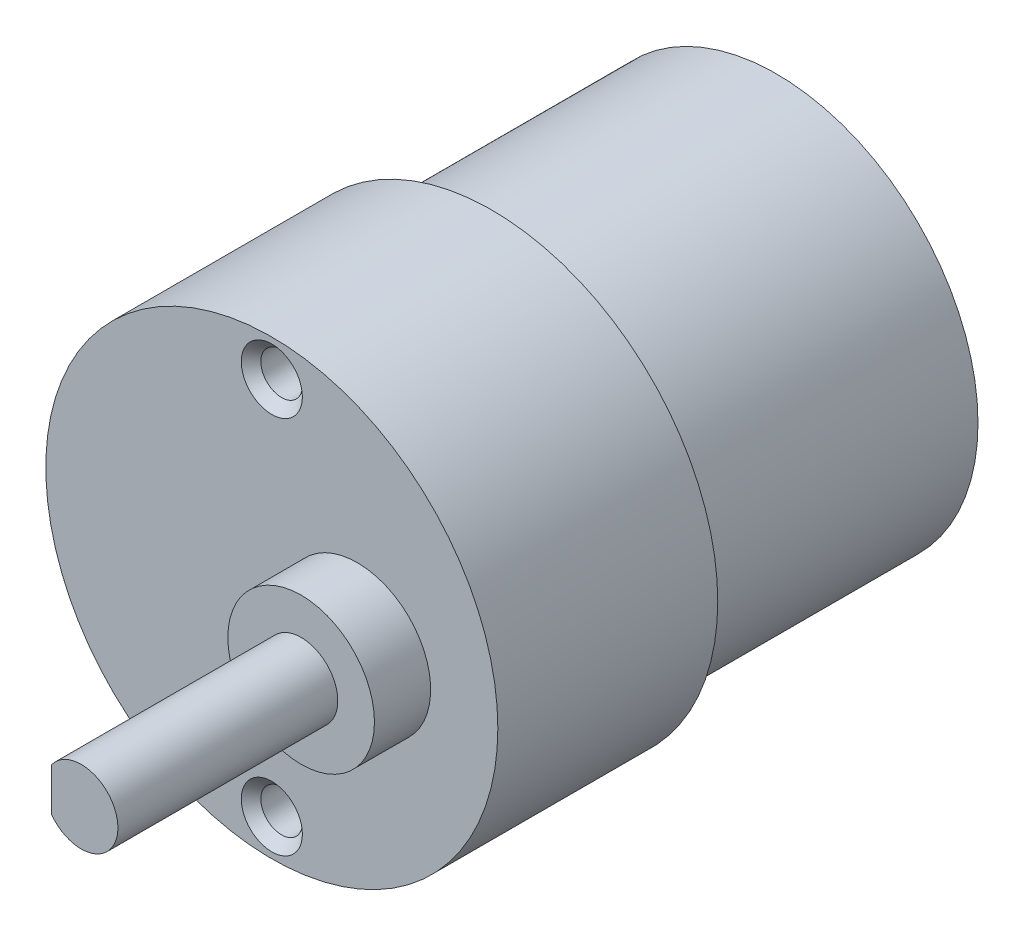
ISO-10303-21;
HEADER;
FILE_DESCRIPTION(('STEP AP214'),'2;1');
FILE_NAME('part.step','',(''),(''),'','','');
FILE_SCHEMA(('AUTOMOTIVE_DESIGN { 1 0 10303 214 1 1 1 1 }'));
ENDSEC;
DATA;
#1=APPLICATION_CONTEXT('core data for automotive mechanical design processes');
#2=APPLICATION_PROTOCOL_DEFINITION('international standard','automotive_design',2000,#1);
#3=PRODUCT_CONTEXT('',#1,'mechanical');
#4=PRODUCT('Part','Part','',(#3));
#5=PRODUCT_RELATED_PRODUCT_CATEGORY('part','',(#4));
#6=PRODUCT_DEFINITION_FORMATION('','',#4);
#7=PRODUCT_DEFINITION_CONTEXT('part definition',#1,'design');
#8=PRODUCT_DEFINITION('design','',#6,#7);
#9=PRODUCT_DEFINITION_SHAPE('','',#8);
#10=(LENGTH_UNIT() NAMED_UNIT(*) SI_UNIT(.MILLI.,.METRE.));
#11=(NAMED_UNIT(*) PLANE_ANGLE_UNIT() SI_UNIT($,.RADIAN.));
#12=(NAMED_UNIT(*) SI_UNIT($,.STERADIAN.) SOLID_ANGLE_UNIT());
#13=UNCERTAINTY_MEASURE_WITH_UNIT(LENGTH_MEASURE(1.E-05),#10,'distance_accuracy_value','');
#14=(GEOMETRIC_REPRESENTATION_CONTEXT(3) GLOBAL_UNCERTAINTY_ASSIGNED_CONTEXT((#13)) GLOBAL_UNIT_ASSIGNED_CONTEXT((#10,
#11,#12)) REPRESENTATION_CONTEXT('',''));
#15=CARTESIAN_POINT('',(0.,0.,0.));
#16=DIRECTION('',(0.,0.,1.));
#17=DIRECTION('',(1.,0.,0.));
#18=AXIS2_PLACEMENT_3D('',#15,#16,#17);
#19=CARTESIAN_POINT('',(25.5,0.,4.6));
#20=DIRECTION('',(0.,0.,1.));
#21=DIRECTION('',(1.,0.,0.));
#22=AXIS2_PLACEMENT_3D('',#19,#20,#21);
#23=PLANE('',#22);
#24=CARTESIAN_POINT('',(25.5,0.,4.6));
#25=DIRECTION('',(0.,0.,1.));
#26=DIRECTION('',(1.,0.,0.));
#27=AXIS2_PLACEMENT_3D('',#24,#25,#26);
#28=CIRCLE('',#27,6.);
#29=CARTESIAN_POINT('',(31.5,0.,4.6));
#30=VERTEX_POINT('',#29);
#31=EDGE_CURVE('E105',#30,#30,#28,.T.);
#32=ORIENTED_EDGE('',*,*,#31,.T.);
#33=EDGE_LOOP('',(#32));
#34=FACE_BOUND('',#33,.T.);
#35=DIRECTION('',(0.,-1.,0.));
#36=VECTOR('',#35,1.);
#37=CARTESIAN_POINT('',(23.0644,-1.75152865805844,4.6));
#38=LINE('',#37,#36);
#39=CARTESIAN_POINT('',(23.0644,1.75152865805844,4.6));
#40=VERTEX_POINT('',#39);
#41=CARTESIAN_POINT('',(23.0644,-1.75152865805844,4.6));
#42=VERTEX_POINT('',#41);
#43=EDGE_CURVE('E63',#40,#42,#38,.T.);
#44=ORIENTED_EDGE('',*,*,#43,.F.);
#45=CARTESIAN_POINT('',(25.5,0.,4.6));
#46=DIRECTION('',(0.,0.,1.));
#47=DIRECTION('',(1.,0.,0.));
#48=AXIS2_PLACEMENT_3D('',#45,#46,#47);
#49=CIRCLE('',#48,3.);
#50=EDGE_CURVE('E46',#42,#40,#49,.T.);
#51=ORIENTED_EDGE('',*,*,#50,.F.);
#52=EDGE_LOOP('',(#44,#51));
#53=FACE_BOUND('',#52,.T.);
#54=ADVANCED_FACE('F31',(#34,#53),#23,.T.);
#55=CARTESIAN_POINT('',(18.5,0.,0.));
#56=DIRECTION('',(0.,0.,-1.));
#57=DIRECTION('',(-1.,0.,0.));
#58=AXIS2_PLACEMENT_3D('',#55,#56,#57);
#59=PLANE('',#58);
#60=CARTESIAN_POINT('',(18.5,15.5,0.));
#61=DIRECTION('',(0.,0.,1.));
#62=DIRECTION('',(1.,0.,0.));
#63=AXIS2_PLACEMENT_3D('',#60,#61,#62);
#64=CIRCLE('',#63,2.5);
#65=CARTESIAN_POINT('',(21.,15.5,0.));
#66=VERTEX_POINT('',#65);
#67=EDGE_CURVE('E87',#66,#66,#64,.T.);
#68=ORIENTED_EDGE('',*,*,#67,.F.);
#69=EDGE_LOOP('',(#68));
#70=FACE_BOUND('',#69,.T.);
#71=CARTESIAN_POINT('',(18.5,-15.5,0.));
#72=DIRECTION('',(0.,0.,1.));
#73=DIRECTION('',(1.,0.,0.));
#74=AXIS2_PLACEMENT_3D('',#71,#72,#73);
#75=CIRCLE('',#74,2.5);
#76=CARTESIAN_POINT('',(21.,-15.5,0.));
#77=VERTEX_POINT('',#76);
#78=EDGE_CURVE('E80',#77,#77,#75,.T.);
#79=ORIENTED_EDGE('',*,*,#78,.F.);
#80=EDGE_LOOP('',(#79));
#81=FACE_BOUND('',#80,.T.);
#82=CARTESIAN_POINT('',(18.5,0.,0.));
#83=DIRECTION('',(0.,0.,1.));
#84=DIRECTION('',(1.,0.,0.));
#85=AXIS2_PLACEMENT_3D('',#82,#83,#84);
#86=CIRCLE('',#85,18.5);
#87=CARTESIAN_POINT('',(37.,0.,0.));
#88=VERTEX_POINT('',#87);
#89=EDGE_CURVE('E39',#88,#88,#86,.T.);
#90=ORIENTED_EDGE('',*,*,#89,.T.);
#91=EDGE_LOOP('',(#90));
#92=FACE_BOUND('',#91,.T.);
#93=CARTESIAN_POINT('',(25.5,0.,0.));
#94=DIRECTION('',(0.,0.,-1.));
#95=DIRECTION('',(-1.,0.,0.));
#96=AXIS2_PLACEMENT_3D('',#93,#94,#95);
#97=CIRCLE('',#96,6.);
#98=CARTESIAN_POINT('',(19.5,0.,0.));
#99=VERTEX_POINT('',#98);
#100=EDGE_CURVE('E11',#99,#99,#97,.F.);
#101=ORIENTED_EDGE('',*,*,#100,.F.);
#102=EDGE_LOOP('',(#101));
#103=FACE_BOUND('',#102,.T.);
#104=ADVANCED_FACE('F33',(#70,#81,#92,#103),#59,.F.);
#105=CARTESIAN_POINT('',(18.5,0.,0.));
#106=DIRECTION('',(0.,0.,1.));
#107=DIRECTION('',(1.,0.,0.));
#108=AXIS2_PLACEMENT_3D('',#105,#106,#107);
#109=CYLINDRICAL_SURFACE('',#108,18.5);
#110=ORIENTED_EDGE('',*,*,#89,.F.);
#111=EDGE_LOOP('',(#110));
#112=FACE_BOUND('',#111,.T.);
#113=CARTESIAN_POINT('',(18.5,0.,-18.));
#114=DIRECTION('',(0.,0.,1.));
#115=DIRECTION('',(1.,0.,0.));
#116=AXIS2_PLACEMENT_3D('',#113,#114,#115);
#117=CIRCLE('',#116,18.5);
#118=CARTESIAN_POINT('',(37.,0.,-18.));
#119=VERTEX_POINT('',#118);
#120=EDGE_CURVE('E114',#119,#119,#117,.T.);
#121=ORIENTED_EDGE('',*,*,#120,.T.);
#122=EDGE_LOOP('',(#121));
#123=FACE_BOUND('',#122,.T.);
#124=ADVANCED_FACE('F121',(#112,#123),#109,.T.);
#125=CARTESIAN_POINT('',(0.,0.,-18.));
#126=DIRECTION('',(0.,0.,1.));
#127=DIRECTION('',(1.,0.,0.));
#128=AXIS2_PLACEMENT_3D('',#125,#126,#127);
#129=PLANE('',#128);
#130=ORIENTED_EDGE('',*,*,#120,.F.);
#131=EDGE_LOOP('',(#130));
#132=FACE_BOUND('',#131,.T.);
#133=CARTESIAN_POINT('',(18.5,0.,-18.));
#134=DIRECTION('',(0.,0.,1.));
#135=DIRECTION('',(1.,0.,0.));
#136=AXIS2_PLACEMENT_3D('',#133,#134,#135);
#137=CIRCLE('',#136,16.5);
#138=CARTESIAN_POINT('',(35.,0.,-18.));
#139=VERTEX_POINT('',#138);
#140=EDGE_CURVE('E111',#139,#139,#137,.T.);
#141=ORIENTED_EDGE('',*,*,#140,.T.);
#142=EDGE_LOOP('',(#141));
#143=FACE_BOUND('',#142,.T.);
#144=ADVANCED_FACE('F124',(#132,#143),#129,.F.);
#145=CARTESIAN_POINT('',(18.5,0.,0.));
#146=DIRECTION('',(0.,0.,1.));
#147=DIRECTION('',(1.,0.,0.));
#148=AXIS2_PLACEMENT_3D('',#145,#146,#147);
#149=CYLINDRICAL_SURFACE('',#148,16.5);
#150=ORIENTED_EDGE('',*,*,#140,.F.);
#151=EDGE_LOOP('',(#150));
#152=FACE_BOUND('',#151,.T.);
#153=CARTESIAN_POINT('',(18.5,0.,-41.3));
#154=DIRECTION('',(0.,0.,1.));
#155=DIRECTION('',(1.,0.,0.));
#156=AXIS2_PLACEMENT_3D('',#153,#154,#155);
#157=CIRCLE('',#156,16.5);
#158=CARTESIAN_POINT('',(35.,0.,-41.3));
#159=VERTEX_POINT('',#158);
#160=EDGE_CURVE('E108',#159,#159,#157,.T.);
#161=ORIENTED_EDGE('',*,*,#160,.T.);
#162=EDGE_LOOP('',(#161));
#163=FACE_BOUND('',#162,.T.);
#164=ADVANCED_FACE('F129',(#152,#163),#149,.T.);
#165=CARTESIAN_POINT('',(2.,0.,-41.3));
#166=DIRECTION('',(0.,0.,1.));
#167=DIRECTION('',(1.,0.,0.));
#168=AXIS2_PLACEMENT_3D('',#165,#166,#167);
#169=PLANE('',#168);
#170=ORIENTED_EDGE('',*,*,#160,.F.);
#171=EDGE_LOOP('',(#170));
#172=FACE_BOUND('',#171,.T.);
#173=ADVANCED_FACE('F135',(#172),#169,.F.);
#174=CARTESIAN_POINT('',(25.5,0.,4.6));
#175=DIRECTION('',(0.,0.,-1.));
#176=DIRECTION('',(-1.,0.,0.));
#177=AXIS2_PLACEMENT_3D('',#174,#175,#176);
#178=CYLINDRICAL_SURFACE('',#177,6.);
#179=ORIENTED_EDGE('',*,*,#31,.F.);
#180=EDGE_LOOP('',(#179));
#181=FACE_BOUND('',#180,.T.);
#182=ORIENTED_EDGE('',*,*,#100,.T.);
#183=EDGE_LOOP('',(#182));
#184=FACE_BOUND('',#183,.T.);
#185=ADVANCED_FACE('F140',(#181,#184),#178,.T.);
#186=CARTESIAN_POINT('',(25.5,0.,22.6));
#187=DIRECTION('',(0.,0.,-1.));
#188=DIRECTION('',(-1.,0.,0.));
#189=AXIS2_PLACEMENT_3D('',#186,#187,#188);
#190=CYLINDRICAL_SURFACE('',#189,3.);
#191=ORIENTED_EDGE('',*,*,#50,.T.);
#192=DIRECTION('',(0.,0.,-1.));
#193=VECTOR('',#192,1.);
#194=CARTESIAN_POINT('',(23.0644,1.75152865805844,22.6));
#195=LINE('',#194,#193);
#196=CARTESIAN_POINT('',(23.0644,1.75152865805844,22.6));
#197=VERTEX_POINT('',#196);
#198=EDGE_CURVE('E103',#197,#40,#195,.T.);
#199=ORIENTED_EDGE('',*,*,#198,.F.);
#200=CARTESIAN_POINT('',(25.5,0.,22.6));
#201=DIRECTION('',(0.,0.,1.));
#202=DIRECTION('',(1.,0.,0.));
#203=AXIS2_PLACEMENT_3D('',#200,#201,#202);
#204=CIRCLE('',#203,3.);
#205=CARTESIAN_POINT('',(23.0644,-1.75152865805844,22.6));
#206=VERTEX_POINT('',#205);
#207=EDGE_CURVE('E96',#206,#197,#204,.T.);
#208=ORIENTED_EDGE('',*,*,#207,.F.);
#209=DIRECTION('',(0.,0.,-1.));
#210=VECTOR('',#209,1.);
#211=CARTESIAN_POINT('',(23.0644,-1.75152865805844,22.6));
#212=LINE('',#211,#210);
#213=EDGE_CURVE('E99',#206,#42,#212,.T.);
#214=ORIENTED_EDGE('',*,*,#213,.T.);
#215=EDGE_LOOP('',(#191,#199,#208,#214));
#216=FACE_BOUND('',#215,.T.);
#217=ADVANCED_FACE('F145',(#216),#190,.T.);
#218=CARTESIAN_POINT('',(23.0644,-1.75152865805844,22.6));
#219=DIRECTION('',(1.,0.,0.));
#220=DIRECTION('',(0.,0.,-1.));
#221=AXIS2_PLACEMENT_3D('',#218,#219,#220);
#222=PLANE('',#221);
#223=ORIENTED_EDGE('',*,*,#43,.T.);
#224=ORIENTED_EDGE('',*,*,#213,.F.);
#225=DIRECTION('',(0.,-1.,0.));
#226=VECTOR('',#225,1.);
#227=CARTESIAN_POINT('',(23.0644,-1.75152865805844,22.6));
#228=LINE('',#227,#226);
#229=EDGE_CURVE('E54',#197,#206,#228,.T.);
#230=ORIENTED_EDGE('',*,*,#229,.F.);
#231=ORIENTED_EDGE('',*,*,#198,.T.);
#232=EDGE_LOOP('',(#223,#224,#230,#231));
#233=FACE_BOUND('',#232,.T.);
#234=ADVANCED_FACE('F159',(#233),#222,.F.);
#235=CARTESIAN_POINT('',(25.5,0.,22.6));
#236=DIRECTION('',(0.,0.,1.));
#237=DIRECTION('',(1.,0.,0.));
#238=AXIS2_PLACEMENT_3D('',#235,#236,#237);
#239=PLANE('',#238);
#240=ORIENTED_EDGE('',*,*,#207,.T.);
#241=ORIENTED_EDGE('',*,*,#229,.T.);
#242=EDGE_LOOP('',(#240,#241));
#243=FACE_BOUND('',#242,.T.);
#244=ADVANCED_FACE('F162',(#243),#239,.T.);
#245=CARTESIAN_POINT('',(18.5,-15.5,-9.99999999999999));
#246=DIRECTION('',(0.,0.,1.));
#247=DIRECTION('',(1.,0.,0.));
#248=AXIS2_PLACEMENT_3D('',#245,#246,#247);
#249=CONICAL_SURFACE('',#248,1.69999999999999,1.02974425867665);
#250=CARTESIAN_POINT('',(18.5,-15.5,-11.0214630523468));
#251=VERTEX_POINT('',#250);
#252=VERTEX_LOOP('',#251);
#253=FACE_BOUND('',#252,.T.);
#254=CARTESIAN_POINT('',(18.5,-15.5,-9.99999999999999));
#255=DIRECTION('',(0.,0.,1.));
#256=DIRECTION('',(1.,0.,0.));
#257=AXIS2_PLACEMENT_3D('',#254,#255,#256);
#258=CIRCLE('',#257,1.69999999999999);
#259=CARTESIAN_POINT('',(20.2,-15.5,-9.99999999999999));
#260=VERTEX_POINT('',#259);
#261=EDGE_CURVE('E93',#260,#260,#258,.T.);
#262=ORIENTED_EDGE('',*,*,#261,.T.);
#263=EDGE_LOOP('',(#262));
#264=FACE_BOUND('',#263,.T.);
#265=ADVANCED_FACE('F165',(#253,#264),#249,.F.);
#266=CARTESIAN_POINT('',(18.5,-15.5,0.));
#267=DIRECTION('',(0.,0.,1.));
#268=DIRECTION('',(1.,0.,0.));
#269=AXIS2_PLACEMENT_3D('',#266,#267,#268);
#270=CYLINDRICAL_SURFACE('',#269,1.69999999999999);
#271=ORIENTED_EDGE('',*,*,#261,.F.);
#272=EDGE_LOOP('',(#271));
#273=FACE_BOUND('',#272,.T.);
#274=CARTESIAN_POINT('',(18.5,-15.5,-0.800000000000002));
#275=DIRECTION('',(0.,0.,1.));
#276=DIRECTION('',(1.,0.,0.));
#277=AXIS2_PLACEMENT_3D('',#274,#275,#276);
#278=CIRCLE('',#277,1.7);
#279=CARTESIAN_POINT('',(20.2,-15.5,-0.800000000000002));
#280=VERTEX_POINT('',#279);
#281=EDGE_CURVE('E84',#280,#280,#278,.T.);
#282=ORIENTED_EDGE('',*,*,#281,.T.);
#283=EDGE_LOOP('',(#282));
#284=FACE_BOUND('',#283,.T.);
#285=ADVANCED_FACE('F168',(#273,#284),#270,.F.);
#286=CARTESIAN_POINT('',(18.5,-15.5,0.));
#287=DIRECTION('',(0.,0.,1.));
#288=DIRECTION('',(1.,0.,0.));
#289=AXIS2_PLACEMENT_3D('',#286,#287,#288);
#290=CONICAL_SURFACE('',#289,2.5,0.785398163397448);
#291=ORIENTED_EDGE('',*,*,#281,.F.);
#292=EDGE_LOOP('',(#291));
#293=FACE_BOUND('',#292,.T.);
#294=ORIENTED_EDGE('',*,*,#78,.T.);
#295=EDGE_LOOP('',(#294));
#296=FACE_BOUND('',#295,.T.);
#297=ADVANCED_FACE('F74',(#293,#296),#290,.F.);
#298=CARTESIAN_POINT('',(18.5,15.5,-9.99999999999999));
#299=DIRECTION('',(0.,0.,1.));
#300=DIRECTION('',(1.,0.,0.));
#301=AXIS2_PLACEMENT_3D('',#298,#299,#300);
#302=CONICAL_SURFACE('',#301,1.69999999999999,1.02974425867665);
#303=CARTESIAN_POINT('',(18.5,15.5,-11.0214630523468));
#304=VERTEX_POINT('',#303);
#305=VERTEX_LOOP('',#304);
#306=FACE_BOUND('',#305,.T.);
#307=CARTESIAN_POINT('',(18.5,15.5,-9.99999999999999));
#308=DIRECTION('',(0.,0.,1.));
#309=DIRECTION('',(1.,0.,0.));
#310=AXIS2_PLACEMENT_3D('',#307,#308,#309);
#311=CIRCLE('',#310,1.69999999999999);
#312=CARTESIAN_POINT('',(20.2,15.5,-9.99999999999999));
#313=VERTEX_POINT('',#312);
#314=EDGE_CURVE('E78',#313,#313,#311,.T.);
#315=ORIENTED_EDGE('',*,*,#314,.T.);
#316=EDGE_LOOP('',(#315));
#317=FACE_BOUND('',#316,.T.);
#318=ADVANCED_FACE('F70',(#306,#317),#302,.F.);
#319=CARTESIAN_POINT('',(18.5,15.5,0.));
#320=DIRECTION('',(0.,0.,1.));
#321=DIRECTION('',(1.,0.,0.));
#322=AXIS2_PLACEMENT_3D('',#319,#320,#321);
#323=CYLINDRICAL_SURFACE('',#322,1.69999999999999);
#324=ORIENTED_EDGE('',*,*,#314,.F.);
#325=EDGE_LOOP('',(#324));
#326=FACE_BOUND('',#325,.T.);
#327=CARTESIAN_POINT('',(18.5,15.5,-0.8));
#328=DIRECTION('',(0.,0.,1.));
#329=DIRECTION('',(1.,0.,0.));
#330=AXIS2_PLACEMENT_3D('',#327,#328,#329);
#331=CIRCLE('',#330,1.7);
#332=CARTESIAN_POINT('',(20.2,15.5,-0.8));
#333=VERTEX_POINT('',#332);
#334=EDGE_CURVE('E81',#333,#333,#331,.T.);
#335=ORIENTED_EDGE('',*,*,#334,.T.);
#336=EDGE_LOOP('',(#335));
#337=FACE_BOUND('',#336,.T.);
#338=ADVANCED_FACE('F73',(#326,#337),#323,.F.);
#339=CARTESIAN_POINT('',(18.5,15.5,0.));
#340=DIRECTION('',(0.,0.,1.));
#341=DIRECTION('',(1.,0.,0.));
#342=AXIS2_PLACEMENT_3D('',#339,#340,#341);
#343=CONICAL_SURFACE('',#342,2.5,0.785398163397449);
#344=ORIENTED_EDGE('',*,*,#334,.F.);
#345=EDGE_LOOP('',(#344));
#346=FACE_BOUND('',#345,.T.);
#347=ORIENTED_EDGE('',*,*,#67,.T.);
#348=EDGE_LOOP('',(#347));
#349=FACE_BOUND('',#348,.T.);
#350=ADVANCED_FACE('F177',(#346,#349),#343,.F.);
#351=CLOSED_SHELL('',(#54,#104,#124,#144,#164,#173,#185,#217,#234,#244,#265,#285,#297,#318,#338,#350));
#352=MANIFOLD_SOLID_BREP('B2',#351);
#353=ADVANCED_BREP_SHAPE_REPRESENTATION('',(#18,#352),#14);
#354=SHAPE_DEFINITION_REPRESENTATION(#9,#353);
ENDSEC;
END-ISO-10303-21;
